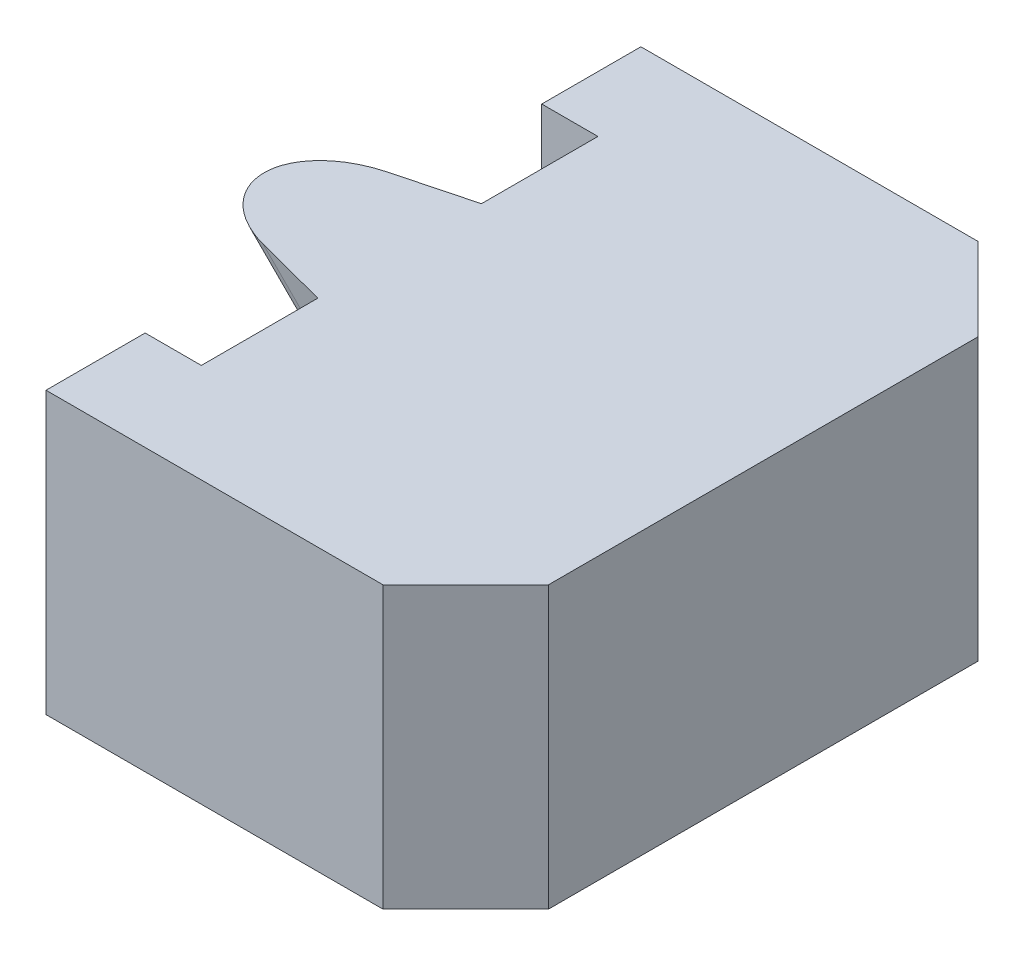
from build123d import *

# Parameters (mm, degrees)
SKIZZE1_W                       = 85.78807947
SKIZZE1_H                       = 57.19205298
LINEAR_AUSTRAGEN1_DEPTH         = 12.5
LINEAR_AUSTRAGEN2_DEPTH         = 8.5
VERRUNDUNG1_R                   = 3
LINEAR_AUSTRAGEN3_DEPTH         = 20
FASE1_SIZE                      = 2.5
SKIZZE5_W                       = 85.78807947
SKIZZE5_H                       = 12.5
SCHNITT_LINEAR_AUSTRAGEN1_DEPTH = 57.19205298


with BuildPart() as part:
    # Skizze1 → Linear austragen1 (new body)
    with BuildSketch(Plane(origin=(0, 0, 0), x_dir=(1, 0, 0), z_dir=(0, 1, 0))):
        with Locations((-1.787251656, -4.766004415)):
            Rectangle(SKIZZE1_W, SKIZZE1_H)
    extrude(amount=LINEAR_AUSTRAGEN1_DEPTH)

    # Skizze2 → Linear austragen2 (add)
    with BuildSketch(Plane.XZ):
        Polygon((-26.360376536, 10.766004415), (-21.660376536, 10.766004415), (-21.660376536, -1.233995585), (-26.360376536, -1.233995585), (-26.360376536, -4.233995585), (-13.660376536, -4.233995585), (-13.660376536, 13.766004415), (-26.360376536, 13.766004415), align=None)
    extrude(amount=LINEAR_AUSTRAGEN2_DEPTH)

    # Verrundung1
    verrundung1_edges = [part.edges().sort_by_distance(p)[0] for p in [
        (-21.660376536, 0, 4.766004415),
    ]]
    fillet(verrundung1_edges, radius=VERRUNDUNG1_R)

    # Skizze4 → Linear austragen3 (add)
    with BuildSketch(Plane(origin=(-19.660376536, -6.5, 4.766004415), x_dir=(0, 0, 1), z_dir=(-0.7071067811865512, 0.707106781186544, 0))):
        with BuildLine():
            Line((-1.883908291, -0.529133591), (-3, 2.471572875))
            Line((-3, 2.471572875), (3, 2.471572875))
            Line((3, 2.471572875), (1.883908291, -0.529133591))
            ThreePointArc((1.883908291, -0.529133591), (0, -1.838427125), (-1.883908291, -0.529133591))
        make_face()
    extrude(amount=LINEAR_AUSTRAGEN3_DEPTH)

    # Fase1
    fase1_edges = [part.edges().sort_by_distance(p)[0] for p in [
        (-13.660376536, -4.25, -4.233995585),
        (-13.660376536, -4.25, 13.766004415),
    ]]
    chamfer(fase1_edges, length=FASE1_SIZE)

    # Skizze5 → Schnitt-Linear austragen1 (cut)
    with BuildSketch(Plane(origin=(0, 0, -23.830022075), x_dir=(-1, 0, 0), z_dir=(0, 0, -1))):
        with Locations((1.787251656, 6.25)):
            Rectangle(SKIZZE5_W, SKIZZE5_H)
    extrude(amount=-SCHNITT_LINEAR_AUSTRAGEN1_DEPTH, mode=Mode.SUBTRACT)


solid = part.part
